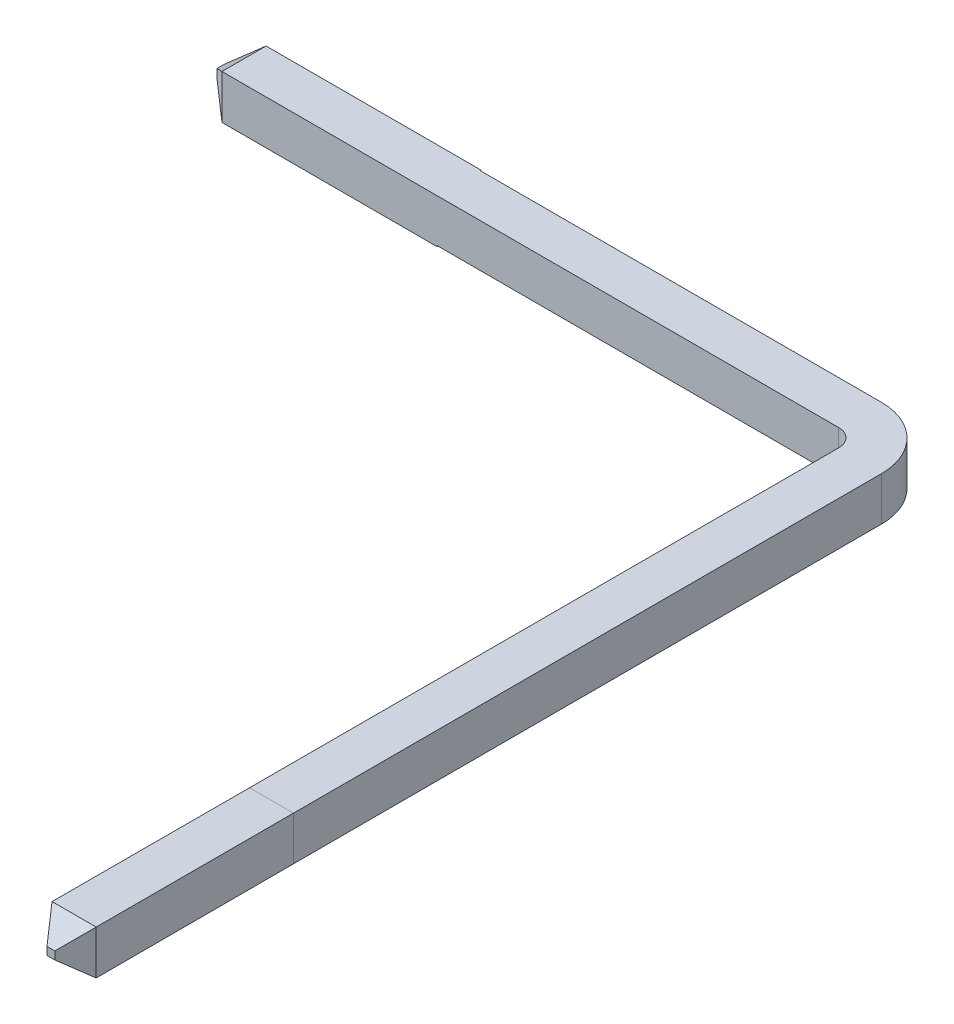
ISO-10303-21;
HEADER;
FILE_DESCRIPTION(('STEP AP214'),'2;1');
FILE_NAME('part.step','',(''),(''),'','','');
FILE_SCHEMA(('AUTOMOTIVE_DESIGN { 1 0 10303 214 1 1 1 1 }'));
ENDSEC;
DATA;
#1=APPLICATION_CONTEXT('core data for automotive mechanical design processes');
#2=APPLICATION_PROTOCOL_DEFINITION('international standard','automotive_design',2000,#1);
#3=PRODUCT_CONTEXT('',#1,'mechanical');
#4=PRODUCT('Part','Part','',(#3));
#5=PRODUCT_RELATED_PRODUCT_CATEGORY('part','',(#4));
#6=PRODUCT_DEFINITION_FORMATION('','',#4);
#7=PRODUCT_DEFINITION_CONTEXT('part definition',#1,'design');
#8=PRODUCT_DEFINITION('design','',#6,#7);
#9=PRODUCT_DEFINITION_SHAPE('','',#8);
#10=(LENGTH_UNIT() NAMED_UNIT(*) SI_UNIT(.MILLI.,.METRE.));
#11=(NAMED_UNIT(*) PLANE_ANGLE_UNIT() SI_UNIT($,.RADIAN.));
#12=(NAMED_UNIT(*) SI_UNIT($,.STERADIAN.) SOLID_ANGLE_UNIT());
#13=UNCERTAINTY_MEASURE_WITH_UNIT(LENGTH_MEASURE(1.E-05),#10,'distance_accuracy_value','');
#14=(GEOMETRIC_REPRESENTATION_CONTEXT(3) GLOBAL_UNCERTAINTY_ASSIGNED_CONTEXT((#13)) GLOBAL_UNIT_ASSIGNED_CONTEXT((#10,
#11,#12)) REPRESENTATION_CONTEXT('',''));
#15=CARTESIAN_POINT('',(0.,0.,0.));
#16=DIRECTION('',(0.,0.,1.));
#17=DIRECTION('',(1.,0.,0.));
#18=AXIS2_PLACEMENT_3D('',#15,#16,#17);
#19=CARTESIAN_POINT('',(-0.00317499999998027,-12.3888499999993,-3.4564409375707));
#20=DIRECTION('',(0.,1.,0.));
#21=DIRECTION('',(0.,0.,-1.));
#22=AXIS2_PLACEMENT_3D('',#19,#20,#21);
#23=PLANE('',#22);
#24=DIRECTION('',(0.,0.,1.));
#25=VECTOR('',#24,1.);
#26=CARTESIAN_POINT('',(0.31115000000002,-12.3888499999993,-3.4564409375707));
#27=LINE('',#26,#25);
#28=CARTESIAN_POINT('',(0.31115000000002,-12.3888499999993,-2.56744093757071));
#29=VERTEX_POINT('',#28);
#30=CARTESIAN_POINT('',(0.314325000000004,-12.3856749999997,5.89710906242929));
#31=VERTEX_POINT('',#30);
#32=EDGE_CURVE('E307',#29,#31,#27,.T.);
#33=ORIENTED_EDGE('',*,*,#32,.F.);
#34=CARTESIAN_POINT('',(-0.57784999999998,-12.3888499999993,-2.56744093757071));
#35=DIRECTION('',(0.,1.,0.));
#36=DIRECTION('',(0.,0.,-1.));
#37=AXIS2_PLACEMENT_3D('',#34,#35,#36);
#38=CIRCLE('',#37,0.889);
#39=CARTESIAN_POINT('',(-0.57784999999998,-12.3888499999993,-3.4564409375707));
#40=VERTEX_POINT('',#39);
#41=EDGE_CURVE('E181',#29,#40,#38,.T.);
#42=ORIENTED_EDGE('',*,*,#41,.T.);
#43=DIRECTION('',(1.,0.,0.));
#44=VECTOR('',#43,1.);
#45=CARTESIAN_POINT('',(-0.00317499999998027,-12.3888499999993,-3.4564409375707));
#46=LINE('',#45,#44);
#47=CARTESIAN_POINT('',(-6.35,-12.3888499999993,-3.4564409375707));
#48=VERTEX_POINT('',#47);
#49=EDGE_CURVE('E284',#48,#40,#46,.T.);
#50=ORIENTED_EDGE('',*,*,#49,.F.);
#51=DIRECTION('',(0.,0.,1.));
#52=VECTOR('',#51,1.);
#53=CARTESIAN_POINT('',(-6.35,-12.3888499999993,-1.88164093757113));
#54=LINE('',#53,#52);
#55=CARTESIAN_POINT('',(-6.35,-12.3888499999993,-3.46914093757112));
#56=VERTEX_POINT('',#55);
#57=EDGE_CURVE('E194',#56,#48,#54,.T.);
#58=ORIENTED_EDGE('',*,*,#57,.F.);
#59=DIRECTION('',(-1.,0.,0.));
#60=VECTOR('',#59,1.);
#61=CARTESIAN_POINT('',(1.85784727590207,-12.3888499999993,-3.4691409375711));
#62=LINE('',#61,#60);
#63=CARTESIAN_POINT('',(-9.44473525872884,-12.3888499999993,-3.46914093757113));
#64=VERTEX_POINT('',#63);
#65=EDGE_CURVE('E197',#56,#64,#62,.T.);
#66=ORIENTED_EDGE('',*,*,#65,.T.);
#67=DIRECTION('',(0.,0.,1.));
#68=VECTOR('',#67,1.);
#69=CARTESIAN_POINT('',(-9.4447352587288,-12.3888499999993,-28.8818409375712));
#70=LINE('',#69,#68);
#71=CARTESIAN_POINT('',(-9.44473525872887,-12.3888499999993,-2.83414093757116));
#72=VERTEX_POINT('',#71);
#73=EDGE_CURVE('E226',#64,#72,#70,.T.);
#74=ORIENTED_EDGE('',*,*,#73,.T.);
#75=DIRECTION('',(-1.,0.,0.));
#76=VECTOR('',#75,1.);
#77=CARTESIAN_POINT('',(-4.733925,-12.3888499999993,-2.83414093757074));
#78=LINE('',#77,#76);
#79=CARTESIAN_POINT('',(-0.571499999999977,-12.3888499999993,-2.83414093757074));
#80=VERTEX_POINT('',#79);
#81=EDGE_CURVE('E279',#80,#72,#78,.T.);
#82=ORIENTED_EDGE('',*,*,#81,.F.);
#83=CARTESIAN_POINT('',(-0.571499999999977,-12.3888499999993,-2.58014093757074));
#84=DIRECTION('',(0.,1.,0.));
#85=DIRECTION('',(0.,0.,-1.));
#86=AXIS2_PLACEMENT_3D('',#83,#84,#85);
#87=CIRCLE('',#86,0.254);
#88=CARTESIAN_POINT('',(-0.317499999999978,-12.3888499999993,-2.58014093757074));
#89=VERTEX_POINT('',#88);
#90=EDGE_CURVE('E357',#80,#89,#87,.F.);
#91=ORIENTED_EDGE('',*,*,#90,.T.);
#92=DIRECTION('',(0.,0.,1.));
#93=VECTOR('',#92,1.);
#94=CARTESIAN_POINT('',(-0.317499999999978,-12.3888499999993,-3.4564409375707));
#95=LINE('',#94,#93);
#96=CARTESIAN_POINT('',(-0.317499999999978,-12.3856749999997,5.89710906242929));
#97=VERTEX_POINT('',#96);
#98=EDGE_CURVE('E347',#89,#97,#95,.T.);
#99=ORIENTED_EDGE('',*,*,#98,.T.);
#100=CARTESIAN_POINT('',(-0.31749999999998,-12.3888499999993,5.8971090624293));
#101=DIRECTION('',(1.,0.,0.));
#102=VECTOR('',#101,1.);
#103=LINE('',#100,#102);
#104=EDGE_CURVE('E143',#97,#31,#103,.T.);
#105=ORIENTED_EDGE('',*,*,#104,.T.);
#106=EDGE_LOOP('',(#33,#42,#50,#58,#66,#74,#82,#91,#99,#105));
#107=FACE_BOUND('',#106,.T.);
#108=ADVANCED_FACE('F17',(#107),#23,.T.);
#109=CARTESIAN_POINT('',(-0.00317499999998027,-12.7031749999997,-3.4564409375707));
#110=DIRECTION('',(0.,0.,-1.));
#111=DIRECTION('',(0.,-1.,0.));
#112=AXIS2_PLACEMENT_3D('',#109,#110,#111);
#113=PLANE('',#112);
#114=ORIENTED_EDGE('',*,*,#49,.T.);
#115=DIRECTION('',(0.,-1.,0.));
#116=VECTOR('',#115,1.);
#117=CARTESIAN_POINT('',(-0.57784999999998,-12.7031749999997,-3.4564409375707));
#118=LINE('',#117,#116);
#119=CARTESIAN_POINT('',(-0.57784999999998,-13.0111499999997,-3.4564409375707));
#120=VERTEX_POINT('',#119);
#121=EDGE_CURVE('E324',#40,#120,#118,.T.);
#122=ORIENTED_EDGE('',*,*,#121,.T.);
#123=DIRECTION('',(-1.,0.,0.));
#124=VECTOR('',#123,1.);
#125=CARTESIAN_POINT('',(-4.733925,-13.0111499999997,-3.4564409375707));
#126=LINE('',#125,#124);
#127=CARTESIAN_POINT('',(-6.35,-13.0111499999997,-3.4564409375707));
#128=VERTEX_POINT('',#127);
#129=EDGE_CURVE('E295',#120,#128,#126,.T.);
#130=ORIENTED_EDGE('',*,*,#129,.T.);
#131=DIRECTION('',(0.,1.,0.));
#132=VECTOR('',#131,1.);
#133=CARTESIAN_POINT('',(-6.35,-12.7031749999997,-3.4564409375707));
#134=LINE('',#133,#132);
#135=EDGE_CURVE('E289',#128,#48,#134,.T.);
#136=ORIENTED_EDGE('',*,*,#135,.T.);
#137=EDGE_LOOP('',(#114,#122,#130,#136));
#138=FACE_BOUND('',#137,.T.);
#139=ADVANCED_FACE('F362',(#138),#113,.T.);
#140=CARTESIAN_POINT('',(-4.733925,-12.6999999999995,-2.83414093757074));
#141=DIRECTION('',(0.,0.,1.));
#142=DIRECTION('',(0.,1.,0.));
#143=AXIS2_PLACEMENT_3D('',#140,#141,#142);
#144=PLANE('',#143);
#145=DIRECTION('',(1.,0.,0.));
#146=VECTOR('',#145,1.);
#147=CARTESIAN_POINT('',(-4.733925,-13.0111499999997,-2.83414093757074));
#148=LINE('',#147,#146);
#149=CARTESIAN_POINT('',(-6.35,-13.0111499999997,-2.83414093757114));
#150=VERTEX_POINT('',#149);
#151=CARTESIAN_POINT('',(-0.571499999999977,-13.0111499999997,-2.83414093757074));
#152=VERTEX_POINT('',#151);
#153=EDGE_CURVE('E283',#150,#152,#148,.T.);
#154=ORIENTED_EDGE('',*,*,#153,.T.);
#155=DIRECTION('',(0.,-1.,0.));
#156=VECTOR('',#155,1.);
#157=CARTESIAN_POINT('',(-0.571499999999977,-12.3888499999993,-2.83414093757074));
#158=LINE('',#157,#156);
#159=EDGE_CURVE('E281',#152,#80,#158,.F.);
#160=ORIENTED_EDGE('',*,*,#159,.T.);
#161=ORIENTED_EDGE('',*,*,#81,.T.);
#162=DIRECTION('',(0.,-1.,0.));
#163=VECTOR('',#162,1.);
#164=CARTESIAN_POINT('',(-9.44473525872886,-13.0238499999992,-2.83414093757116));
#165=LINE('',#164,#163);
#166=CARTESIAN_POINT('',(-9.44473525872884,-13.0238499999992,-2.83414093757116));
#167=VERTEX_POINT('',#166);
#168=EDGE_CURVE('E209',#167,#72,#165,.F.);
#169=ORIENTED_EDGE('',*,*,#168,.F.);
#170=DIRECTION('',(-1.,0.,0.));
#171=VECTOR('',#170,1.);
#172=CARTESIAN_POINT('',(1.85784727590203,-13.0238499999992,-2.83414093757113));
#173=LINE('',#172,#171);
#174=CARTESIAN_POINT('',(-6.35,-13.0238499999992,-2.83414093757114));
#175=VERTEX_POINT('',#174);
#176=EDGE_CURVE('E202',#175,#167,#173,.T.);
#177=ORIENTED_EDGE('',*,*,#176,.F.);
#178=DIRECTION('',(0.,-1.,0.));
#179=VECTOR('',#178,1.);
#180=CARTESIAN_POINT('',(-6.35,-15.2463499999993,-2.83414093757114));
#181=LINE('',#180,#179);
#182=EDGE_CURVE('E200',#150,#175,#181,.T.);
#183=ORIENTED_EDGE('',*,*,#182,.F.);
#184=EDGE_LOOP('',(#154,#160,#161,#169,#177,#183));
#185=FACE_BOUND('',#184,.T.);
#186=ADVANCED_FACE('F277',(#185),#144,.T.);
#187=CARTESIAN_POINT('',(-4.733925,-13.0111499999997,-3.4564409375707));
#188=DIRECTION('',(0.,-1.,0.));
#189=DIRECTION('',(0.,0.,1.));
#190=AXIS2_PLACEMENT_3D('',#187,#188,#189);
#191=PLANE('',#190);
#192=ORIENTED_EDGE('',*,*,#129,.F.);
#193=CARTESIAN_POINT('',(-0.57784999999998,-13.0111499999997,-2.56744093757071));
#194=DIRECTION('',(0.,-1.,0.));
#195=DIRECTION('',(0.,0.,1.));
#196=AXIS2_PLACEMENT_3D('',#193,#194,#195);
#197=CIRCLE('',#196,0.889);
#198=CARTESIAN_POINT('',(-0.317499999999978,-13.0111499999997,-3.41746380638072));
#199=VERTEX_POINT('',#198);
#200=EDGE_CURVE('E320',#120,#199,#197,.T.);
#201=ORIENTED_EDGE('',*,*,#200,.T.);
#202=DIRECTION('',(0.,0.,-1.));
#203=VECTOR('',#202,1.);
#204=CARTESIAN_POINT('',(-0.317499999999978,-13.0111499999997,-3.4564409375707));
#205=LINE('',#204,#203);
#206=CARTESIAN_POINT('',(-0.317499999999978,-13.0111499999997,-2.58014093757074));
#207=VERTEX_POINT('',#206);
#208=EDGE_CURVE('E328',#207,#199,#205,.T.);
#209=ORIENTED_EDGE('',*,*,#208,.F.);
#210=CARTESIAN_POINT('',(-0.571499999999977,-13.0111499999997,-2.58014093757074));
#211=DIRECTION('',(0.,-1.,0.));
#212=DIRECTION('',(0.,0.,1.));
#213=AXIS2_PLACEMENT_3D('',#210,#211,#212);
#214=CIRCLE('',#213,0.254);
#215=EDGE_CURVE('E355',#207,#152,#214,.F.);
#216=ORIENTED_EDGE('',*,*,#215,.T.);
#217=ORIENTED_EDGE('',*,*,#153,.F.);
#218=DIRECTION('',(0.,0.,-1.));
#219=VECTOR('',#218,1.);
#220=CARTESIAN_POINT('',(-6.35,-13.0111499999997,-3.4564409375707));
#221=LINE('',#220,#219);
#222=EDGE_CURVE('E286',#150,#128,#221,.T.);
#223=ORIENTED_EDGE('',*,*,#222,.T.);
#224=EDGE_LOOP('',(#192,#201,#209,#216,#217,#223));
#225=FACE_BOUND('',#224,.T.);
#226=ADVANCED_FACE('F369',(#225),#191,.T.);
#227=CARTESIAN_POINT('',(-0.317499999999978,-12.7031749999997,-3.4564409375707));
#228=DIRECTION('',(-1.,0.,0.));
#229=DIRECTION('',(0.,0.,-1.));
#230=AXIS2_PLACEMENT_3D('',#227,#228,#229);
#231=PLANE('',#230);
#232=DIRECTION('',(0.,-1.,0.));
#233=VECTOR('',#232,1.);
#234=CARTESIAN_POINT('',(-0.317499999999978,-12.7031749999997,8.73784432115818));
#235=LINE('',#234,#233);
#236=CARTESIAN_POINT('',(-0.317499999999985,-12.3825,8.73784432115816));
#237=VERTEX_POINT('',#236);
#238=CARTESIAN_POINT('',(-0.317499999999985,-13.0175,8.73784432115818));
#239=VERTEX_POINT('',#238);
#240=EDGE_CURVE('E26',#237,#239,#235,.T.);
#241=ORIENTED_EDGE('',*,*,#240,.F.);
#242=DIRECTION('',(0.,0.,1.));
#243=VECTOR('',#242,1.);
#244=CARTESIAN_POINT('',(-0.31749999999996,-12.3825,-2.31073821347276));
#245=LINE('',#244,#243);
#246=EDGE_CURVE('E137',#97,#237,#245,.T.);
#247=ORIENTED_EDGE('',*,*,#246,.F.);
#248=ORIENTED_EDGE('',*,*,#98,.F.);
#249=DIRECTION('',(0.,-1.,0.));
#250=VECTOR('',#249,1.);
#251=CARTESIAN_POINT('',(-0.317499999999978,-13.0111499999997,-2.58014093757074));
#252=LINE('',#251,#250);
#253=EDGE_CURVE('E351',#89,#207,#252,.T.);
#254=ORIENTED_EDGE('',*,*,#253,.T.);
#255=ORIENTED_EDGE('',*,*,#208,.T.);
#256=DIRECTION('',(0.,-1.,0.));
#257=VECTOR('',#256,1.);
#258=CARTESIAN_POINT('',(-0.317499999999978,-13.0111499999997,-3.41746380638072));
#259=LINE('',#258,#257);
#260=CARTESIAN_POINT('',(-0.317499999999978,-13.0175,-3.41746380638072));
#261=VERTEX_POINT('',#260);
#262=EDGE_CURVE('E317',#199,#261,#259,.T.);
#263=ORIENTED_EDGE('',*,*,#262,.T.);
#264=DIRECTION('',(0.,0.,1.));
#265=VECTOR('',#264,1.);
#266=CARTESIAN_POINT('',(-0.317499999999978,-13.0175,-3.4564409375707));
#267=LINE('',#266,#265);
#268=EDGE_CURVE('E155',#261,#239,#267,.T.);
#269=ORIENTED_EDGE('',*,*,#268,.T.);
#270=EDGE_LOOP('',(#241,#247,#248,#254,#255,#263,#269));
#271=FACE_BOUND('',#270,.T.);
#272=ADVANCED_FACE('F153',(#271),#231,.T.);
#273=CARTESIAN_POINT('',(-0.00317499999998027,-13.0175,-3.4564409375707));
#274=DIRECTION('',(0.,-1.,0.));
#275=DIRECTION('',(0.,0.,1.));
#276=AXIS2_PLACEMENT_3D('',#273,#274,#275);
#277=PLANE('',#276);
#278=DIRECTION('',(1.,0.,0.));
#279=VECTOR('',#278,1.);
#280=CARTESIAN_POINT('',(-0.00317500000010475,-13.0175,8.73784432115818));
#281=LINE('',#280,#279);
#282=CARTESIAN_POINT('',(0.317499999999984,-13.0175,8.73784432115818));
#283=VERTEX_POINT('',#282);
#284=EDGE_CURVE('E158',#239,#283,#281,.T.);
#285=ORIENTED_EDGE('',*,*,#284,.F.);
#286=ORIENTED_EDGE('',*,*,#268,.F.);
#287=CARTESIAN_POINT('',(-0.57784999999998,-13.0175,-2.56744093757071));
#288=DIRECTION('',(0.,-1.,0.));
#289=DIRECTION('',(0.,0.,1.));
#290=AXIS2_PLACEMENT_3D('',#287,#288,#289);
#291=CIRCLE('',#290,0.889);
#292=CARTESIAN_POINT('',(0.31115000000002,-13.0175,-2.56744093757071));
#293=VERTEX_POINT('',#292);
#294=EDGE_CURVE('E312',#261,#293,#291,.T.);
#295=ORIENTED_EDGE('',*,*,#294,.T.);
#296=DIRECTION('',(0.,0.,1.));
#297=VECTOR('',#296,1.);
#298=CARTESIAN_POINT('',(0.31115000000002,-13.0175,-3.4564409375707));
#299=LINE('',#298,#297);
#300=CARTESIAN_POINT('',(0.314325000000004,-13.0175,5.89710906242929));
#301=VERTEX_POINT('',#300);
#302=EDGE_CURVE('E311',#293,#301,#299,.T.);
#303=ORIENTED_EDGE('',*,*,#302,.T.);
#304=DIRECTION('',(0.,0.,1.));
#305=VECTOR('',#304,1.);
#306=CARTESIAN_POINT('',(0.317500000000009,-13.0175,-2.31073821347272));
#307=LINE('',#306,#305);
#308=EDGE_CURVE('E148',#301,#283,#307,.T.);
#309=ORIENTED_EDGE('',*,*,#308,.T.);
#310=EDGE_LOOP('',(#285,#286,#295,#303,#309));
#311=FACE_BOUND('',#310,.T.);
#312=ADVANCED_FACE('F401',(#311),#277,.T.);
#313=CARTESIAN_POINT('',(0.31115000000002,-12.7031749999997,-3.4564409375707));
#314=DIRECTION('',(1.,0.,0.));
#315=DIRECTION('',(0.,0.,1.));
#316=AXIS2_PLACEMENT_3D('',#313,#314,#315);
#317=PLANE('',#316);
#318=ORIENTED_EDGE('',*,*,#302,.F.);
#319=DIRECTION('',(0.,-1.,0.));
#320=VECTOR('',#319,1.);
#321=CARTESIAN_POINT('',(0.31115000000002,-12.7031749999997,-2.56744093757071));
#322=LINE('',#321,#320);
#323=EDGE_CURVE('E185',#293,#29,#322,.F.);
#324=ORIENTED_EDGE('',*,*,#323,.T.);
#325=ORIENTED_EDGE('',*,*,#32,.T.);
#326=CARTESIAN_POINT('',(0.31115000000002,-12.3888499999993,5.8971090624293));
#327=DIRECTION('',(0.,-1.,0.));
#328=VECTOR('',#327,1.);
#329=LINE('',#326,#328);
#330=EDGE_CURVE('E310',#31,#301,#329,.T.);
#331=ORIENTED_EDGE('',*,*,#330,.T.);
#332=EDGE_LOOP('',(#318,#324,#325,#331));
#333=FACE_BOUND('',#332,.T.);
#334=ADVANCED_FACE('F375',(#333),#317,.T.);
#335=CARTESIAN_POINT('',(0.317500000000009,-13.0175,-2.31073821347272));
#336=DIRECTION('',(1.,0.,0.));
#337=DIRECTION('',(0.,1.,0.));
#338=AXIS2_PLACEMENT_3D('',#335,#336,#337);
#339=PLANE('',#338);
#340=DIRECTION('',(0.,1.,0.));
#341=VECTOR('',#340,1.);
#342=CARTESIAN_POINT('',(0.317499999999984,-13.0175,8.73784432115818));
#343=LINE('',#342,#341);
#344=CARTESIAN_POINT('',(0.317499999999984,-12.3825,8.73784432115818));
#345=VERTEX_POINT('',#344);
#346=EDGE_CURVE('E32',#283,#345,#343,.T.);
#347=ORIENTED_EDGE('',*,*,#346,.F.);
#348=ORIENTED_EDGE('',*,*,#308,.F.);
#349=ORIENTED_EDGE('',*,*,#330,.F.);
#350=DIRECTION('',(0.,0.,1.));
#351=VECTOR('',#350,1.);
#352=CARTESIAN_POINT('',(0.317500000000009,-12.3825,-2.31073821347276));
#353=LINE('',#352,#351);
#354=EDGE_CURVE('E147',#31,#345,#353,.T.);
#355=ORIENTED_EDGE('',*,*,#354,.T.);
#356=EDGE_LOOP('',(#347,#348,#349,#355));
#357=FACE_BOUND('',#356,.T.);
#358=ADVANCED_FACE('F377',(#357),#339,.T.);
#359=CARTESIAN_POINT('',(-0.31749999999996,-12.3825,-2.31073821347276));
#360=DIRECTION('',(0.,1.,0.));
#361=DIRECTION('',(0.,0.,1.));
#362=AXIS2_PLACEMENT_3D('',#359,#360,#361);
#363=PLANE('',#362);
#364=DIRECTION('',(-1.,0.,0.));
#365=VECTOR('',#364,1.);
#366=CARTESIAN_POINT('',(-0.317500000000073,-12.3825,8.73784432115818));
#367=LINE('',#366,#365);
#368=EDGE_CURVE('E11',#345,#237,#367,.T.);
#369=ORIENTED_EDGE('',*,*,#368,.F.);
#370=ORIENTED_EDGE('',*,*,#354,.F.);
#371=ORIENTED_EDGE('',*,*,#104,.F.);
#372=ORIENTED_EDGE('',*,*,#246,.T.);
#373=EDGE_LOOP('',(#369,#370,#371,#372));
#374=FACE_BOUND('',#373,.T.);
#375=ADVANCED_FACE('F139',(#374),#363,.T.);
#376=CARTESIAN_POINT('',(-9.779,-16.8396794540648,-5.69164093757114));
#377=DIRECTION('',(1.,0.,0.));
#378=DIRECTION('',(0.,-1.,0.));
#379=AXIS2_PLACEMENT_3D('',#376,#377,#378);
#380=PLANE('',#379);
#381=DIRECTION('',(0.,0.,-1.));
#382=VECTOR('',#381,1.);
#383=CARTESIAN_POINT('',(-9.779,-12.6500062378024,-5.69164093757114));
#384=LINE('',#383,#382);
#385=CARTESIAN_POINT('',(-9.779,-12.6500062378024,-3.09529717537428));
#386=VERTEX_POINT('',#385);
#387=CARTESIAN_POINT('',(-9.779,-12.6500062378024,-3.207984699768));
#388=VERTEX_POINT('',#387);
#389=EDGE_CURVE('E198',#386,#388,#384,.T.);
#390=ORIENTED_EDGE('',*,*,#389,.T.);
#391=DIRECTION('',(0.,-1.,0.));
#392=VECTOR('',#391,1.);
#393=CARTESIAN_POINT('',(-9.779,-16.8396794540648,-3.207984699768));
#394=LINE('',#393,#392);
#395=CARTESIAN_POINT('',(-9.779,-12.7626937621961,-3.207984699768));
#396=VERTEX_POINT('',#395);
#397=EDGE_CURVE('E215',#388,#396,#394,.T.);
#398=ORIENTED_EDGE('',*,*,#397,.T.);
#399=DIRECTION('',(0.,0.,-1.));
#400=VECTOR('',#399,1.);
#401=CARTESIAN_POINT('',(-9.779,-12.7626937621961,-5.69164093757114));
#402=LINE('',#401,#400);
#403=CARTESIAN_POINT('',(-9.779,-12.7626937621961,-3.09529717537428));
#404=VERTEX_POINT('',#403);
#405=EDGE_CURVE('E230',#404,#396,#402,.T.);
#406=ORIENTED_EDGE('',*,*,#405,.F.);
#407=DIRECTION('',(0.,-1.,0.));
#408=VECTOR('',#407,1.);
#409=CARTESIAN_POINT('',(-9.779,-16.8396794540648,-3.09529717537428));
#410=LINE('',#409,#408);
#411=EDGE_CURVE('E233',#386,#404,#410,.T.);
#412=ORIENTED_EDGE('',*,*,#411,.F.);
#413=EDGE_LOOP('',(#390,#398,#406,#412));
#414=FACE_BOUND('',#413,.T.);
#415=ADVANCED_FACE('F396',(#414),#380,.F.);
#416=CARTESIAN_POINT('',(-9.55856592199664,-15.5765499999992,-2.923075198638));
#417=DIRECTION('',(0.615661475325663,0.,-0.788010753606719));
#418=DIRECTION('',(-0.788010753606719,0.,-0.615661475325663));
#419=AXIS2_PLACEMENT_3D('',#416,#417,#418);
#420=PLANE('',#419);
#421=ORIENTED_EDGE('',*,*,#168,.T.);
#422=DIRECTION('',(0.671032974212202,0.524268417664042,0.524268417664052));
#423=VECTOR('',#422,1.);
#424=CARTESIAN_POINT('',(-18.3707600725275,-19.3626248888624,-9.80791582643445));
#425=LINE('',#424,#423);
#426=EDGE_CURVE('E219',#386,#72,#425,.T.);
#427=ORIENTED_EDGE('',*,*,#426,.F.);
#428=ORIENTED_EDGE('',*,*,#411,.T.);
#429=DIRECTION('',(0.671032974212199,-0.524268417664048,0.52426841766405));
#430=VECTOR('',#429,1.);
#431=CARTESIAN_POINT('',(-10.3285801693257,-12.3333146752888,-3.5246762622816));
#432=LINE('',#431,#430);
#433=EDGE_CURVE('E222',#404,#167,#432,.T.);
#434=ORIENTED_EDGE('',*,*,#433,.T.);
#435=EDGE_LOOP('',(#421,#427,#428,#434));
#436=FACE_BOUND('',#435,.T.);
#437=ADVANCED_FACE('F274',(#436),#420,.F.);
#438=CARTESIAN_POINT('',(-9.18347271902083,-15.5765499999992,-3.67326160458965));
#439=DIRECTION('',(-0.615661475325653,0.,-0.788010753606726));
#440=DIRECTION('',(-0.788010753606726,0.,0.615661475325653));
#441=AXIS2_PLACEMENT_3D('',#438,#439,#440);
#442=PLANE('',#441);
#443=DIRECTION('',(0.,1.,0.));
#444=VECTOR('',#443,1.);
#445=CARTESIAN_POINT('',(-9.44473525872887,-12.3888499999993,-3.46914093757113));
#446=LINE('',#445,#444);
#447=CARTESIAN_POINT('',(-9.44473525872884,-13.0238499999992,-3.46914093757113));
#448=VERTEX_POINT('',#447);
#449=EDGE_CURVE('E191',#64,#448,#446,.F.);
#450=ORIENTED_EDGE('',*,*,#449,.T.);
#451=DIRECTION('',(0.671032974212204,-0.52426841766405,-0.524268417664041));
#452=VECTOR('',#451,1.);
#453=CARTESIAN_POINT('',(-8.30909943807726,-13.9111059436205,-4.35639688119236));
#454=LINE('',#453,#452);
#455=EDGE_CURVE('E218',#396,#448,#454,.T.);
#456=ORIENTED_EDGE('',*,*,#455,.F.);
#457=ORIENTED_EDGE('',*,*,#397,.F.);
#458=DIRECTION('',(0.671032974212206,0.524268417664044,-0.524268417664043));
#459=VECTOR('',#458,1.);
#460=CARTESIAN_POINT('',(-0.266919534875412,-5.2183544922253,-10.6396364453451));
#461=LINE('',#460,#459);
#462=EDGE_CURVE('E223',#388,#64,#461,.T.);
#463=ORIENTED_EDGE('',*,*,#462,.T.);
#464=EDGE_LOOP('',(#450,#456,#457,#463));
#465=FACE_BOUND('',#464,.T.);
#466=ADVANCED_FACE('F259',(#465),#442,.T.);
#467=CARTESIAN_POINT('',(-9.11708606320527,-13.2798376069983,-6.02184093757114));
#468=DIRECTION('',(0.615661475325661,0.78801075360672,0.));
#469=DIRECTION('',(0.78801075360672,-0.615661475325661,0.));
#470=AXIS2_PLACEMENT_3D('',#467,#468,#469);
#471=PLANE('',#470);
#472=ORIENTED_EDGE('',*,*,#433,.F.);
#473=ORIENTED_EDGE('',*,*,#405,.T.);
#474=ORIENTED_EDGE('',*,*,#455,.T.);
#475=DIRECTION('',(0.,0.,-1.));
#476=VECTOR('',#475,1.);
#477=CARTESIAN_POINT('',(-9.44473525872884,-13.0238499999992,-6.02184093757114));
#478=LINE('',#477,#476);
#479=EDGE_CURVE('E227',#167,#448,#478,.T.);
#480=ORIENTED_EDGE('',*,*,#479,.F.);
#481=EDGE_LOOP('',(#472,#473,#474,#480));
#482=FACE_BOUND('',#481,.T.);
#483=ADVANCED_FACE('F254',(#482),#471,.F.);
#484=CARTESIAN_POINT('',(-9.11708606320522,-12.1328623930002,-28.8818409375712));
#485=DIRECTION('',(-0.615661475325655,0.788010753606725,0.));
#486=DIRECTION('',(0.788010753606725,0.615661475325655,0.));
#487=AXIS2_PLACEMENT_3D('',#484,#485,#486);
#488=PLANE('',#487);
#489=ORIENTED_EDGE('',*,*,#462,.F.);
#490=ORIENTED_EDGE('',*,*,#389,.F.);
#491=ORIENTED_EDGE('',*,*,#426,.T.);
#492=ORIENTED_EDGE('',*,*,#73,.F.);
#493=EDGE_LOOP('',(#489,#490,#491,#492));
#494=FACE_BOUND('',#493,.T.);
#495=ADVANCED_FACE('F269',(#494),#488,.T.);
#496=CARTESIAN_POINT('',(1.85784727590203,-13.0238499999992,-2.83414093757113));
#497=DIRECTION('',(0.,1.,0.));
#498=DIRECTION('',(-1.,0.,0.));
#499=AXIS2_PLACEMENT_3D('',#496,#497,#498);
#500=PLANE('',#499);
#501=DIRECTION('',(0.,0.,1.));
#502=VECTOR('',#501,1.);
#503=CARTESIAN_POINT('',(-6.35,-13.0238499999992,-1.88164093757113));
#504=LINE('',#503,#502);
#505=CARTESIAN_POINT('',(-6.35,-13.0238499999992,-3.46914093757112));
#506=VERTEX_POINT('',#505);
#507=EDGE_CURVE('E210',#506,#175,#504,.T.);
#508=ORIENTED_EDGE('',*,*,#507,.T.);
#509=ORIENTED_EDGE('',*,*,#176,.T.);
#510=ORIENTED_EDGE('',*,*,#479,.T.);
#511=DIRECTION('',(1.,0.,0.));
#512=VECTOR('',#511,1.);
#513=CARTESIAN_POINT('',(1.85784727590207,-13.0238499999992,-3.4691409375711));
#514=LINE('',#513,#512);
#515=EDGE_CURVE('E203',#448,#506,#514,.T.);
#516=ORIENTED_EDGE('',*,*,#515,.T.);
#517=EDGE_LOOP('',(#508,#509,#510,#516));
#518=FACE_BOUND('',#517,.T.);
#519=ADVANCED_FACE('F249',(#518),#500,.F.);
#520=CARTESIAN_POINT('',(1.85784727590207,-12.3888499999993,-3.4691409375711));
#521=DIRECTION('',(0.,0.,1.));
#522=DIRECTION('',(0.,1.,0.));
#523=AXIS2_PLACEMENT_3D('',#520,#521,#522);
#524=PLANE('',#523);
#525=DIRECTION('',(0.,-1.,0.));
#526=VECTOR('',#525,1.);
#527=CARTESIAN_POINT('',(-6.35,-15.2463499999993,-3.46914093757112));
#528=LINE('',#527,#526);
#529=EDGE_CURVE('E213',#56,#506,#528,.T.);
#530=ORIENTED_EDGE('',*,*,#529,.T.);
#531=ORIENTED_EDGE('',*,*,#515,.F.);
#532=ORIENTED_EDGE('',*,*,#449,.F.);
#533=ORIENTED_EDGE('',*,*,#65,.F.);
#534=EDGE_LOOP('',(#530,#531,#532,#533));
#535=FACE_BOUND('',#534,.T.);
#536=ADVANCED_FACE('F520',(#535),#524,.F.);
#537=CARTESIAN_POINT('',(-6.35,-20.6438499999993,-3.46914093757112));
#538=DIRECTION('',(-1.,0.,0.));
#539=DIRECTION('',(0.,0.,1.));
#540=AXIS2_PLACEMENT_3D('',#537,#538,#539);
#541=PLANE('',#540);
#542=ORIENTED_EDGE('',*,*,#135,.F.);
#543=ORIENTED_EDGE('',*,*,#222,.F.);
#544=ORIENTED_EDGE('',*,*,#182,.T.);
#545=ORIENTED_EDGE('',*,*,#507,.F.);
#546=ORIENTED_EDGE('',*,*,#529,.F.);
#547=ORIENTED_EDGE('',*,*,#57,.T.);
#548=EDGE_LOOP('',(#542,#543,#544,#545,#546,#547));
#549=FACE_BOUND('',#548,.T.);
#550=ADVANCED_FACE('F529',(#549),#541,.F.);
#551=CARTESIAN_POINT('',(-0.571499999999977,-12.7031749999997,-2.58014093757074));
#552=DIRECTION('',(0.,1.,0.));
#553=DIRECTION('',(0.,0.,-1.));
#554=AXIS2_PLACEMENT_3D('',#551,#552,#553);
#555=CYLINDRICAL_SURFACE('',#554,0.254);
#556=ORIENTED_EDGE('',*,*,#90,.F.);
#557=ORIENTED_EDGE('',*,*,#159,.F.);
#558=ORIENTED_EDGE('',*,*,#215,.F.);
#559=ORIENTED_EDGE('',*,*,#253,.F.);
#560=EDGE_LOOP('',(#556,#557,#558,#559));
#561=FACE_BOUND('',#560,.T.);
#562=ADVANCED_FACE('F538',(#561),#555,.F.);
#563=CARTESIAN_POINT('',(-0.57784999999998,-12.7031749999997,-2.56744093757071));
#564=DIRECTION('',(0.,-1.,0.));
#565=DIRECTION('',(0.,0.,1.));
#566=AXIS2_PLACEMENT_3D('',#563,#564,#565);
#567=CYLINDRICAL_SURFACE('',#566,0.889);
#568=ORIENTED_EDGE('',*,*,#41,.F.);
#569=ORIENTED_EDGE('',*,*,#323,.F.);
#570=ORIENTED_EDGE('',*,*,#294,.F.);
#571=ORIENTED_EDGE('',*,*,#262,.F.);
#572=ORIENTED_EDGE('',*,*,#200,.F.);
#573=ORIENTED_EDGE('',*,*,#121,.F.);
#574=EDGE_LOOP('',(#568,#569,#570,#571,#572,#573));
#575=FACE_BOUND('',#574,.T.);
#576=ADVANCED_FACE('F374',(#575),#567,.T.);
#577=CARTESIAN_POINT('',(-2.54,-16.8333294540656,9.07210906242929));
#578=DIRECTION('',(0.,0.,-1.));
#579=DIRECTION('',(0.,-1.,0.));
#580=AXIS2_PLACEMENT_3D('',#577,#578,#579);
#581=PLANE('',#580);
#582=DIRECTION('',(-1.,0.,0.));
#583=VECTOR('',#582,1.);
#584=CARTESIAN_POINT('',(-2.54,-12.6436562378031,9.07210906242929));
#585=LINE('',#584,#583);
#586=CARTESIAN_POINT('',(0.0563437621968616,-12.6436562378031,9.0721090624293));
#587=VERTEX_POINT('',#586);
#588=CARTESIAN_POINT('',(-0.0563437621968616,-12.6436562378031,9.0721090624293));
#589=VERTEX_POINT('',#588);
#590=EDGE_CURVE('E173',#587,#589,#585,.T.);
#591=ORIENTED_EDGE('',*,*,#590,.T.);
#592=DIRECTION('',(0.,-1.,0.));
#593=VECTOR('',#592,1.);
#594=CARTESIAN_POINT('',(-0.0563437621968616,-16.8333294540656,9.0721090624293));
#595=LINE('',#594,#593);
#596=CARTESIAN_POINT('',(-0.0563437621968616,-12.7563437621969,9.0721090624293));
#597=VERTEX_POINT('',#596);
#598=EDGE_CURVE('E164',#589,#597,#595,.T.);
#599=ORIENTED_EDGE('',*,*,#598,.T.);
#600=DIRECTION('',(-1.,0.,0.));
#601=VECTOR('',#600,1.);
#602=CARTESIAN_POINT('',(-2.54,-12.7563437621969,9.07210906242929));
#603=LINE('',#602,#601);
#604=CARTESIAN_POINT('',(0.0563437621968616,-12.7563437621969,9.0721090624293));
#605=VERTEX_POINT('',#604);
#606=EDGE_CURVE('E168',#605,#597,#603,.T.);
#607=ORIENTED_EDGE('',*,*,#606,.F.);
#608=DIRECTION('',(0.,-1.,0.));
#609=VECTOR('',#608,1.);
#610=CARTESIAN_POINT('',(0.0563437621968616,-16.8333294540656,9.0721090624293));
#611=LINE('',#610,#609);
#612=EDGE_CURVE('E177',#587,#605,#611,.T.);
#613=ORIENTED_EDGE('',*,*,#612,.F.);
#614=EDGE_LOOP('',(#591,#599,#607,#613));
#615=FACE_BOUND('',#614,.T.);
#616=ADVANCED_FACE('F555',(#615),#581,.F.);
#617=CARTESIAN_POINT('',(-25.7302,-12.1265123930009,8.41019512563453));
#618=DIRECTION('',(0.,0.788010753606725,0.615661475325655));
#619=DIRECTION('',(0.,0.615661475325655,-0.788010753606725));
#620=AXIS2_PLACEMENT_3D('',#617,#618,#619);
#621=PLANE('',#620);
#622=DIRECTION('',(-0.524268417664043,0.524268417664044,-0.671032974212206));
#623=VECTOR('',#622,1.);
#624=CARTESIAN_POINT('',(-7.48799550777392,-5.21200449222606,-0.439971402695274));
#625=LINE('',#624,#623);
#626=EDGE_CURVE('E161',#589,#237,#625,.T.);
#627=ORIENTED_EDGE('',*,*,#626,.F.);
#628=ORIENTED_EDGE('',*,*,#590,.F.);
#629=DIRECTION('',(0.524268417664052,0.524268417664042,-0.671032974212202));
#630=VECTOR('',#629,1.);
#631=CARTESIAN_POINT('',(-6.65627488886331,-19.3562748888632,17.6638691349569));
#632=LINE('',#631,#630);
#633=EDGE_CURVE('E172',#587,#345,#632,.T.);
#634=ORIENTED_EDGE('',*,*,#633,.T.);
#635=ORIENTED_EDGE('',*,*,#368,.T.);
#636=EDGE_LOOP('',(#627,#628,#634,#635));
#637=FACE_BOUND('',#636,.T.);
#638=ADVANCED_FACE('F171',(#637),#621,.T.);
#639=CARTESIAN_POINT('',(0.228565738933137,-15.5702,8.85167498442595));
#640=DIRECTION('',(-0.788010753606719,0.,-0.615661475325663));
#641=DIRECTION('',(-0.615661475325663,0.,0.788010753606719));
#642=AXIS2_PLACEMENT_3D('',#639,#640,#641);
#643=PLANE('',#642);
#644=ORIENTED_EDGE('',*,*,#346,.T.);
#645=ORIENTED_EDGE('',*,*,#633,.F.);
#646=ORIENTED_EDGE('',*,*,#612,.T.);
#647=DIRECTION('',(0.52426841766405,-0.524268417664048,-0.671032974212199));
#648=VECTOR('',#647,1.);
#649=CARTESIAN_POINT('',(-0.37303532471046,-12.3269646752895,9.62168923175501));
#650=LINE('',#649,#648);
#651=EDGE_CURVE('E169',#605,#283,#650,.T.);
#652=ORIENTED_EDGE('',*,*,#651,.T.);
#653=EDGE_LOOP('',(#644,#645,#646,#652));
#654=FACE_BOUND('',#653,.T.);
#655=ADVANCED_FACE('F180',(#654),#643,.F.);
#656=CARTESIAN_POINT('',(-0.52162066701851,-15.5702,8.47658178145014));
#657=DIRECTION('',(-0.788010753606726,0.,0.615661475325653));
#658=DIRECTION('',(0.615661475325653,0.,0.788010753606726));
#659=AXIS2_PLACEMENT_3D('',#656,#657,#658);
#660=PLANE('',#659);
#661=ORIENTED_EDGE('',*,*,#240,.T.);
#662=DIRECTION('',(-0.524268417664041,-0.52426841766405,-0.671032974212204));
#663=VECTOR('',#662,1.);
#664=CARTESIAN_POINT('',(-1.20475594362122,-13.9047559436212,7.60220850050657));
#665=LINE('',#664,#663);
#666=EDGE_CURVE('E240',#597,#239,#665,.T.);
#667=ORIENTED_EDGE('',*,*,#666,.F.);
#668=ORIENTED_EDGE('',*,*,#598,.F.);
#669=ORIENTED_EDGE('',*,*,#626,.T.);
#670=EDGE_LOOP('',(#661,#667,#668,#669));
#671=FACE_BOUND('',#670,.T.);
#672=ADVANCED_FACE('F162',(#671),#660,.T.);
#673=CARTESIAN_POINT('',(-2.8702,-13.273487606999,8.41019512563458));
#674=DIRECTION('',(0.,0.78801075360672,-0.615661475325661));
#675=DIRECTION('',(0.,-0.615661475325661,-0.78801075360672));
#676=AXIS2_PLACEMENT_3D('',#673,#674,#675);
#677=PLANE('',#676);
#678=ORIENTED_EDGE('',*,*,#651,.F.);
#679=ORIENTED_EDGE('',*,*,#606,.T.);
#680=ORIENTED_EDGE('',*,*,#666,.T.);
#681=ORIENTED_EDGE('',*,*,#284,.T.);
#682=EDGE_LOOP('',(#678,#679,#680,#681));
#683=FACE_BOUND('',#682,.T.);
#684=ADVANCED_FACE('F589',(#683),#677,.F.);
#685=CLOSED_SHELL('',(#108,#139,#186,#226,#272,#312,#334,#358,#375,#415,#437,#466,#483,#495,
#519,#536,#550,#562,#576,#616,#638,#655,#672,#684));
#686=MANIFOLD_SOLID_BREP('B1',#685);
#687=ADVANCED_BREP_SHAPE_REPRESENTATION('',(#18,#686),#14);
#688=SHAPE_DEFINITION_REPRESENTATION(#9,#687);
ENDSEC;
END-ISO-10303-21;
